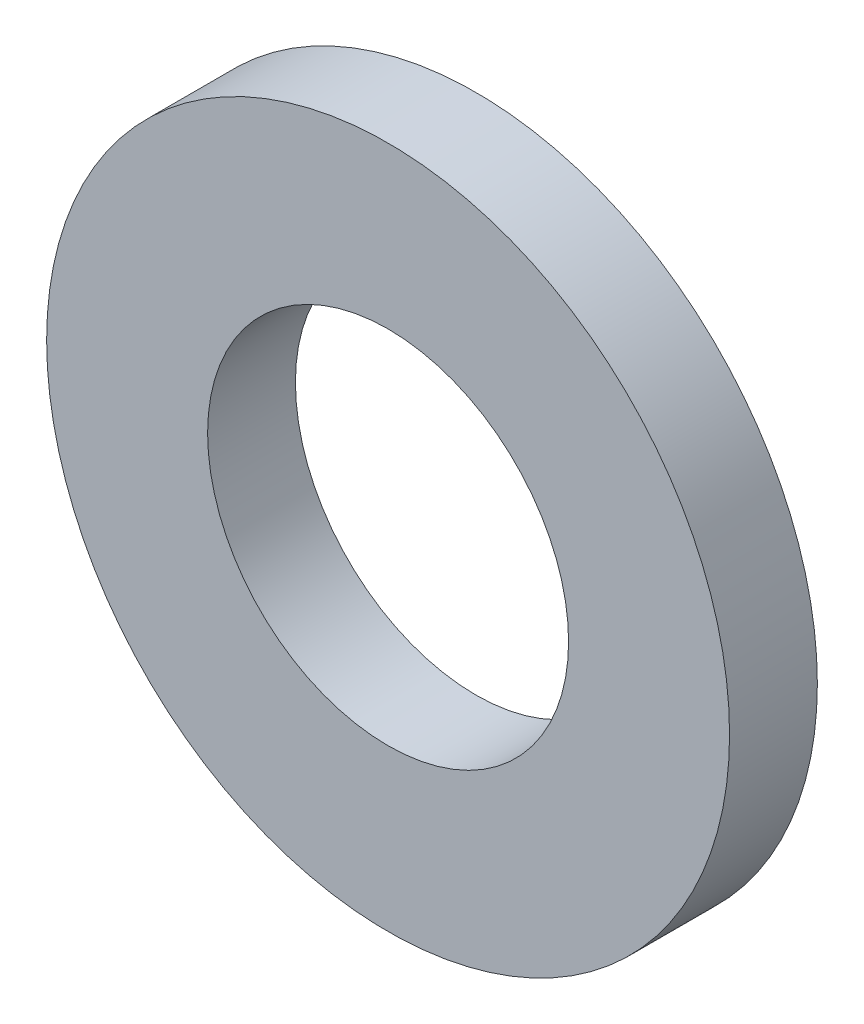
from build123d import *

# Parameters (mm, degrees)
SKETCH1_R           = 7
SKETCH1_R_2         = 3.7
BOSS_EXTRUDE1_DEPTH = 1.8


with BuildPart() as part:
    # Sketch1 → Boss-Extrude1 (new body)
    with BuildSketch(Plane.XY):
        Circle(SKETCH1_R)
        Circle(SKETCH1_R_2, mode=Mode.SUBTRACT)
    extrude(amount=BOSS_EXTRUDE1_DEPTH)


solid = part.part
